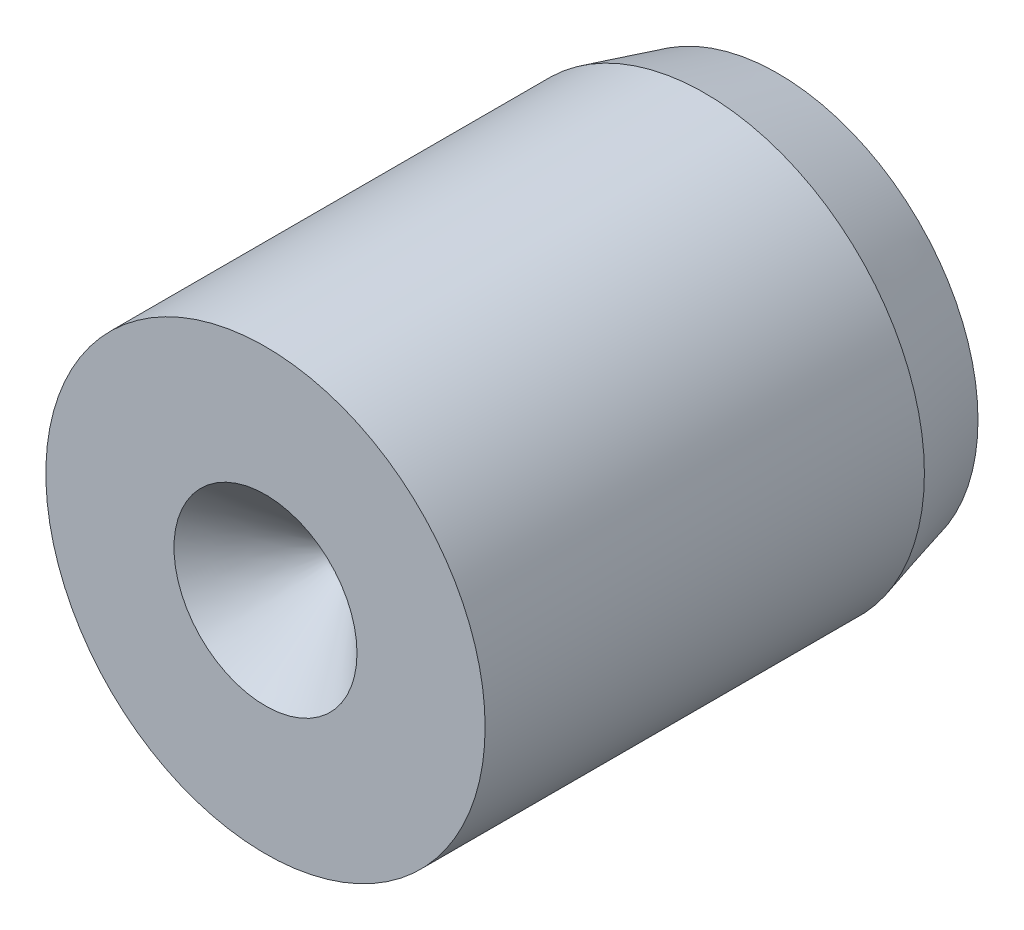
ISO-10303-21;
HEADER;
FILE_DESCRIPTION(('STEP AP214'),'2;1');
FILE_NAME('part.step','',(''),(''),'','','');
FILE_SCHEMA(('AUTOMOTIVE_DESIGN { 1 0 10303 214 1 1 1 1 }'));
ENDSEC;
DATA;
#1=APPLICATION_CONTEXT('core data for automotive mechanical design processes');
#2=APPLICATION_PROTOCOL_DEFINITION('international standard','automotive_design',2000,#1);
#3=PRODUCT_CONTEXT('',#1,'mechanical');
#4=PRODUCT('Part','Part','',(#3));
#5=PRODUCT_RELATED_PRODUCT_CATEGORY('part','',(#4));
#6=PRODUCT_DEFINITION_FORMATION('','',#4);
#7=PRODUCT_DEFINITION_CONTEXT('part definition',#1,'design');
#8=PRODUCT_DEFINITION('design','',#6,#7);
#9=PRODUCT_DEFINITION_SHAPE('','',#8);
#10=(LENGTH_UNIT() NAMED_UNIT(*) SI_UNIT(.MILLI.,.METRE.));
#11=(NAMED_UNIT(*) PLANE_ANGLE_UNIT() SI_UNIT($,.RADIAN.));
#12=(NAMED_UNIT(*) SI_UNIT($,.STERADIAN.) SOLID_ANGLE_UNIT());
#13=UNCERTAINTY_MEASURE_WITH_UNIT(LENGTH_MEASURE(1.E-05),#10,'distance_accuracy_value','');
#14=(GEOMETRIC_REPRESENTATION_CONTEXT(3) GLOBAL_UNCERTAINTY_ASSIGNED_CONTEXT((#13)) GLOBAL_UNIT_ASSIGNED_CONTEXT((#10,
#11,#12)) REPRESENTATION_CONTEXT('',''));
#15=CARTESIAN_POINT('',(0.,0.,0.));
#16=DIRECTION('',(0.,0.,1.));
#17=DIRECTION('',(1.,0.,0.));
#18=AXIS2_PLACEMENT_3D('',#15,#16,#17);
#19=CARTESIAN_POINT('',(0.,6.,14.));
#20=DIRECTION('',(0.,0.,-1.));
#21=DIRECTION('',(-1.,0.,0.));
#22=AXIS2_PLACEMENT_3D('',#19,#20,#21);
#23=PLANE('',#22);
#24=CARTESIAN_POINT('',(0.,0.,14.));
#25=DIRECTION('',(0.,0.,1.));
#26=DIRECTION('',(1.,0.,0.));
#27=AXIS2_PLACEMENT_3D('',#24,#25,#26);
#28=CIRCLE('',#27,2.5);
#29=CARTESIAN_POINT('',(2.5,0.,14.));
#30=VERTEX_POINT('',#29);
#31=EDGE_CURVE('E9',#30,#30,#28,.T.);
#32=ORIENTED_EDGE('',*,*,#31,.F.);
#33=EDGE_LOOP('',(#32));
#34=FACE_BOUND('',#33,.T.);
#35=CARTESIAN_POINT('',(0.,0.,14.));
#36=DIRECTION('',(0.,0.,1.));
#37=DIRECTION('',(1.,0.,0.));
#38=AXIS2_PLACEMENT_3D('',#35,#36,#37);
#39=CIRCLE('',#38,6.);
#40=CARTESIAN_POINT('',(6.,0.,14.));
#41=VERTEX_POINT('',#40);
#42=EDGE_CURVE('E33',#41,#41,#39,.T.);
#43=ORIENTED_EDGE('',*,*,#42,.T.);
#44=EDGE_LOOP('',(#43));
#45=FACE_BOUND('',#44,.T.);
#46=ADVANCED_FACE('F14',(#34,#45),#23,.F.);
#47=CARTESIAN_POINT('',(0.,0.,14.));
#48=DIRECTION('',(0.,0.,1.));
#49=DIRECTION('',(1.,0.,0.));
#50=AXIS2_PLACEMENT_3D('',#47,#48,#49);
#51=CONICAL_SURFACE('',#50,2.5,0.78539816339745);
#52=CARTESIAN_POINT('',(0.,0.,11.5));
#53=VERTEX_POINT('',#52);
#54=VERTEX_LOOP('',#53);
#55=FACE_BOUND('',#54,.T.);
#56=ORIENTED_EDGE('',*,*,#31,.T.);
#57=EDGE_LOOP('',(#56));
#58=FACE_BOUND('',#57,.T.);
#59=ADVANCED_FACE('F23',(#55,#58),#51,.F.);
#60=CARTESIAN_POINT('',(0.,5.46410161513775,0.));
#61=DIRECTION('',(0.,0.,-1.));
#62=DIRECTION('',(-1.,0.,0.));
#63=AXIS2_PLACEMENT_3D('',#60,#61,#62);
#64=PLANE('',#63);
#65=CARTESIAN_POINT('',(0.,0.,0.));
#66=DIRECTION('',(0.,0.,1.));
#67=DIRECTION('',(1.,0.,0.));
#68=AXIS2_PLACEMENT_3D('',#65,#66,#67);
#69=CIRCLE('',#68,5.46410161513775);
#70=CARTESIAN_POINT('',(5.46410161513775,0.,0.));
#71=VERTEX_POINT('',#70);
#72=EDGE_CURVE('E20',#71,#71,#69,.T.);
#73=ORIENTED_EDGE('',*,*,#72,.F.);
#74=EDGE_LOOP('',(#73));
#75=FACE_BOUND('',#74,.T.);
#76=ADVANCED_FACE('F26',(#75),#64,.T.);
#77=CARTESIAN_POINT('',(0.,0.,2.));
#78=DIRECTION('',(0.,0.,1.));
#79=DIRECTION('',(1.,0.,0.));
#80=AXIS2_PLACEMENT_3D('',#77,#78,#79);
#81=CONICAL_SURFACE('',#80,6.,0.26179938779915);
#82=ORIENTED_EDGE('',*,*,#72,.T.);
#83=EDGE_LOOP('',(#82));
#84=FACE_BOUND('',#83,.T.);
#85=CARTESIAN_POINT('',(0.,0.,2.));
#86=DIRECTION('',(0.,0.,1.));
#87=DIRECTION('',(1.,0.,0.));
#88=AXIS2_PLACEMENT_3D('',#85,#86,#87);
#89=CIRCLE('',#88,6.);
#90=CARTESIAN_POINT('',(6.,0.,2.));
#91=VERTEX_POINT('',#90);
#92=EDGE_CURVE('E35',#91,#91,#89,.T.);
#93=ORIENTED_EDGE('',*,*,#92,.F.);
#94=EDGE_LOOP('',(#93));
#95=FACE_BOUND('',#94,.T.);
#96=ADVANCED_FACE('F42',(#84,#95),#81,.T.);
#97=CARTESIAN_POINT('',(0.,0.,7.));
#98=DIRECTION('',(0.,0.,1.));
#99=DIRECTION('',(1.,0.,0.));
#100=AXIS2_PLACEMENT_3D('',#97,#98,#99);
#101=CYLINDRICAL_SURFACE('',#100,6.);
#102=ORIENTED_EDGE('',*,*,#92,.T.);
#103=EDGE_LOOP('',(#102));
#104=FACE_BOUND('',#103,.T.);
#105=ORIENTED_EDGE('',*,*,#42,.F.);
#106=EDGE_LOOP('',(#105));
#107=FACE_BOUND('',#106,.T.);
#108=ADVANCED_FACE('F51',(#104,#107),#101,.T.);
#109=CLOSED_SHELL('',(#46,#59,#76,#96,#108));
#110=MANIFOLD_SOLID_BREP('B1',#109);
#111=ADVANCED_BREP_SHAPE_REPRESENTATION('',(#18,#110),#14);
#112=SHAPE_DEFINITION_REPRESENTATION(#9,#111);
ENDSEC;
END-ISO-10303-21;
